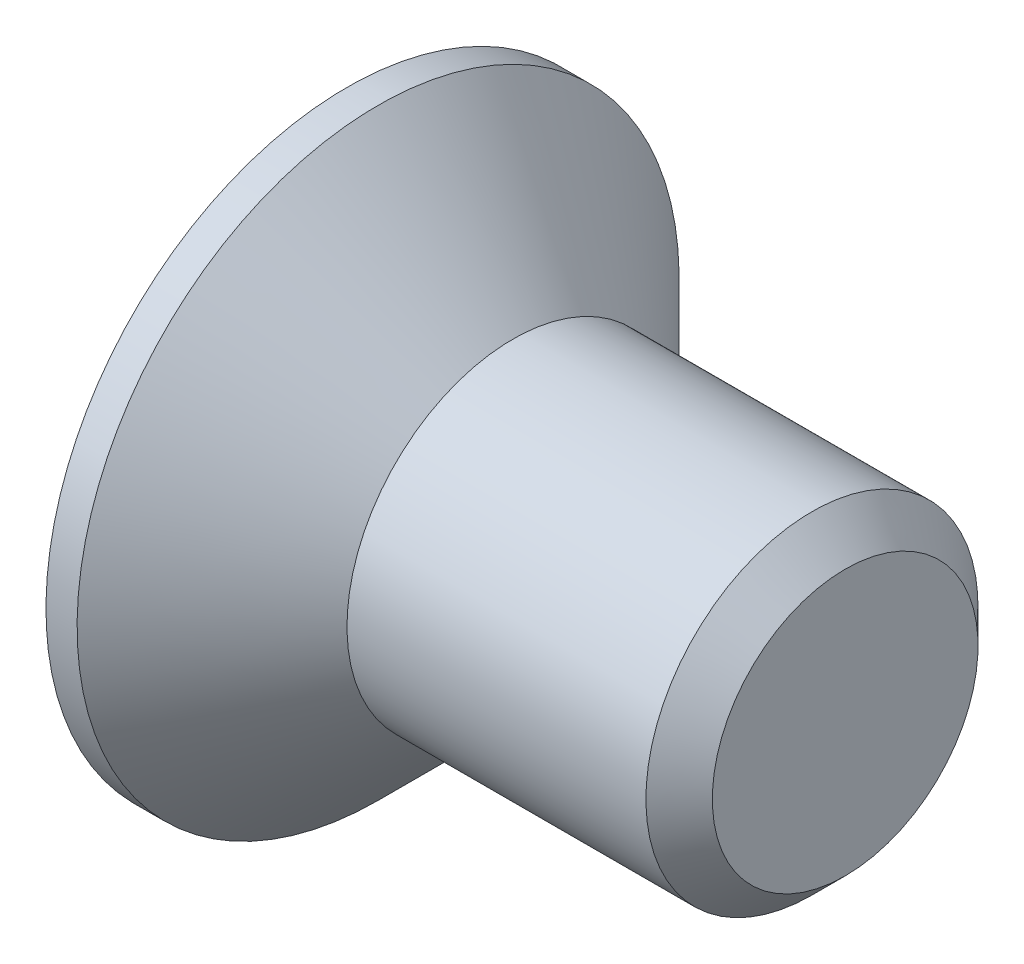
ISO-10303-21;
HEADER;
FILE_DESCRIPTION(('STEP AP214'),'2;1');
FILE_NAME('part.step','',(''),(''),'','','');
FILE_SCHEMA(('AUTOMOTIVE_DESIGN { 1 0 10303 214 1 1 1 1 }'));
ENDSEC;
DATA;
#1=APPLICATION_CONTEXT('core data for automotive mechanical design processes');
#2=APPLICATION_PROTOCOL_DEFINITION('international standard','automotive_design',2000,#1);
#3=PRODUCT_CONTEXT('',#1,'mechanical');
#4=PRODUCT('Part','Part','',(#3));
#5=PRODUCT_RELATED_PRODUCT_CATEGORY('part','',(#4));
#6=PRODUCT_DEFINITION_FORMATION('','',#4);
#7=PRODUCT_DEFINITION_CONTEXT('part definition',#1,'design');
#8=PRODUCT_DEFINITION('design','',#6,#7);
#9=PRODUCT_DEFINITION_SHAPE('','',#8);
#10=(LENGTH_UNIT() NAMED_UNIT(*) SI_UNIT(.MILLI.,.METRE.));
#11=(NAMED_UNIT(*) PLANE_ANGLE_UNIT() SI_UNIT($,.RADIAN.));
#12=(NAMED_UNIT(*) SI_UNIT($,.STERADIAN.) SOLID_ANGLE_UNIT());
#13=UNCERTAINTY_MEASURE_WITH_UNIT(LENGTH_MEASURE(1.E-05),#10,'distance_accuracy_value','');
#14=(GEOMETRIC_REPRESENTATION_CONTEXT(3) GLOBAL_UNCERTAINTY_ASSIGNED_CONTEXT((#13)) GLOBAL_UNIT_ASSIGNED_CONTEXT((#10,
#11,#12)) REPRESENTATION_CONTEXT('',''));
#15=CARTESIAN_POINT('',(0.,0.,0.));
#16=DIRECTION('',(0.,0.,1.));
#17=DIRECTION('',(1.,0.,0.));
#18=AXIS2_PLACEMENT_3D('',#15,#16,#17);
#19=CARTESIAN_POINT('',(0.,0.,0.));
#20=DIRECTION('',(-1.,0.,0.));
#21=DIRECTION('',(0.,-1.,0.));
#22=AXIS2_PLACEMENT_3D('',#19,#20,#21);
#23=CONICAL_SURFACE('',#22,4.,0.78539816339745);
#24=CARTESIAN_POINT('',(-3.24999999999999,0.,0.));
#25=DIRECTION('',(-1.,0.,0.));
#26=DIRECTION('',(0.,-1.,0.));
#27=AXIS2_PLACEMENT_3D('',#24,#25,#26);
#28=CIRCLE('',#27,7.25);
#29=CARTESIAN_POINT('',(-3.24999999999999,-7.25,0.));
#30=VERTEX_POINT('',#29);
#31=EDGE_CURVE('E189',#30,#30,#28,.T.);
#32=ORIENTED_EDGE('',*,*,#31,.F.);
#33=EDGE_LOOP('',(#32));
#34=FACE_BOUND('',#33,.T.);
#35=CARTESIAN_POINT('',(0.,0.,0.));
#36=DIRECTION('',(-1.,0.,0.));
#37=DIRECTION('',(0.,-1.,0.));
#38=AXIS2_PLACEMENT_3D('',#35,#36,#37);
#39=CIRCLE('',#38,4.);
#40=CARTESIAN_POINT('',(0.,-4.,0.));
#41=VERTEX_POINT('',#40);
#42=EDGE_CURVE('E212',#41,#41,#39,.T.);
#43=ORIENTED_EDGE('',*,*,#42,.T.);
#44=EDGE_LOOP('',(#43));
#45=FACE_BOUND('',#44,.T.);
#46=ADVANCED_FACE('F33',(#34,#45),#23,.T.);
#47=CARTESIAN_POINT('',(-4.,0.,0.));
#48=DIRECTION('',(-1.,0.,0.));
#49=DIRECTION('',(0.,-1.,0.));
#50=AXIS2_PLACEMENT_3D('',#47,#48,#49);
#51=CYLINDRICAL_SURFACE('',#50,4.);
#52=CARTESIAN_POINT('',(7.2,0.,0.));
#53=DIRECTION('',(-1.,0.,0.));
#54=DIRECTION('',(0.,-1.,0.));
#55=AXIS2_PLACEMENT_3D('',#52,#53,#54);
#56=CIRCLE('',#55,4.);
#57=CARTESIAN_POINT('',(7.2,-4.,0.));
#58=VERTEX_POINT('',#57);
#59=EDGE_CURVE('E41',#58,#58,#56,.T.);
#60=ORIENTED_EDGE('',*,*,#59,.T.);
#61=EDGE_LOOP('',(#60));
#62=FACE_BOUND('',#61,.T.);
#63=ORIENTED_EDGE('',*,*,#42,.F.);
#64=EDGE_LOOP('',(#63));
#65=FACE_BOUND('',#64,.T.);
#66=ADVANCED_FACE('F217',(#62,#65),#51,.T.);
#67=CARTESIAN_POINT('',(8.,0.,0.));
#68=DIRECTION('',(-1.,0.,0.));
#69=DIRECTION('',(0.,-1.,0.));
#70=AXIS2_PLACEMENT_3D('',#67,#68,#69);
#71=PLANE('',#70);
#72=CARTESIAN_POINT('',(8.,0.,0.));
#73=DIRECTION('',(-1.,0.,0.));
#74=DIRECTION('',(0.,-1.,0.));
#75=AXIS2_PLACEMENT_3D('',#72,#73,#74);
#76=CIRCLE('',#75,3.2);
#77=CARTESIAN_POINT('',(8.,-3.2,0.));
#78=VERTEX_POINT('',#77);
#79=EDGE_CURVE('E11',#78,#78,#76,.F.);
#80=ORIENTED_EDGE('',*,*,#79,.T.);
#81=EDGE_LOOP('',(#80));
#82=FACE_BOUND('',#81,.T.);
#83=ADVANCED_FACE('F239',(#82),#71,.F.);
#84=CARTESIAN_POINT('',(-4.,7.25,0.));
#85=DIRECTION('',(1.,0.,0.));
#86=DIRECTION('',(0.,1.,0.));
#87=AXIS2_PLACEMENT_3D('',#84,#85,#86);
#88=PLANE('',#87);
#89=DIRECTION('',(0.,0.,-1.));
#90=VECTOR('',#89,1.);
#91=CARTESIAN_POINT('',(-4.,1.09,-4.35));
#92=LINE('',#91,#90);
#93=CARTESIAN_POINT('',(-4.,1.09,-1.09));
#94=VERTEX_POINT('',#93);
#95=CARTESIAN_POINT('',(-4.,1.09,-4.35));
#96=VERTEX_POINT('',#95);
#97=EDGE_CURVE('E158',#94,#96,#92,.T.);
#98=ORIENTED_EDGE('',*,*,#97,.F.);
#99=DIRECTION('',(0.,-1.,0.));
#100=VECTOR('',#99,1.);
#101=CARTESIAN_POINT('',(-4.,1.09,-1.09));
#102=LINE('',#101,#100);
#103=CARTESIAN_POINT('',(-4.,4.35,-1.09));
#104=VERTEX_POINT('',#103);
#105=EDGE_CURVE('E48',#104,#94,#102,.T.);
#106=ORIENTED_EDGE('',*,*,#105,.F.);
#107=DIRECTION('',(0.,0.,-1.));
#108=VECTOR('',#107,1.);
#109=CARTESIAN_POINT('',(-4.,4.35,-1.09));
#110=LINE('',#109,#108);
#111=CARTESIAN_POINT('',(-4.,4.35,1.09));
#112=VERTEX_POINT('',#111);
#113=EDGE_CURVE('E185',#112,#104,#110,.T.);
#114=ORIENTED_EDGE('',*,*,#113,.F.);
#115=DIRECTION('',(0.,1.,0.));
#116=VECTOR('',#115,1.);
#117=CARTESIAN_POINT('',(-4.,4.35,1.09));
#118=LINE('',#117,#116);
#119=CARTESIAN_POINT('',(-4.,1.09,1.09));
#120=VERTEX_POINT('',#119);
#121=EDGE_CURVE('E183',#120,#112,#118,.T.);
#122=ORIENTED_EDGE('',*,*,#121,.F.);
#123=DIRECTION('',(0.,0.,-1.));
#124=VECTOR('',#123,1.);
#125=CARTESIAN_POINT('',(-4.,1.09,1.09));
#126=LINE('',#125,#124);
#127=CARTESIAN_POINT('',(-4.,1.09,4.35));
#128=VERTEX_POINT('',#127);
#129=EDGE_CURVE('E132',#128,#120,#126,.T.);
#130=ORIENTED_EDGE('',*,*,#129,.F.);
#131=DIRECTION('',(0.,1.,0.));
#132=VECTOR('',#131,1.);
#133=CARTESIAN_POINT('',(-4.,1.09,4.35));
#134=LINE('',#133,#132);
#135=CARTESIAN_POINT('',(-4.,-1.09,4.35));
#136=VERTEX_POINT('',#135);
#137=EDGE_CURVE('E179',#136,#128,#134,.T.);
#138=ORIENTED_EDGE('',*,*,#137,.F.);
#139=DIRECTION('',(0.,0.,1.));
#140=VECTOR('',#139,1.);
#141=CARTESIAN_POINT('',(-4.,-1.09,4.35));
#142=LINE('',#141,#140);
#143=CARTESIAN_POINT('',(-4.,-1.09,1.09));
#144=VERTEX_POINT('',#143);
#145=EDGE_CURVE('E176',#144,#136,#142,.T.);
#146=ORIENTED_EDGE('',*,*,#145,.F.);
#147=DIRECTION('',(0.,1.,0.));
#148=VECTOR('',#147,1.);
#149=CARTESIAN_POINT('',(-4.,-1.09,1.09));
#150=LINE('',#149,#148);
#151=CARTESIAN_POINT('',(-4.,-4.35,1.09));
#152=VERTEX_POINT('',#151);
#153=EDGE_CURVE('E173',#152,#144,#150,.T.);
#154=ORIENTED_EDGE('',*,*,#153,.F.);
#155=DIRECTION('',(0.,0.,1.));
#156=VECTOR('',#155,1.);
#157=CARTESIAN_POINT('',(-4.,-4.35,1.09));
#158=LINE('',#157,#156);
#159=CARTESIAN_POINT('',(-4.,-4.35,-1.09));
#160=VERTEX_POINT('',#159);
#161=EDGE_CURVE('E170',#160,#152,#158,.T.);
#162=ORIENTED_EDGE('',*,*,#161,.F.);
#163=DIRECTION('',(0.,-1.,0.));
#164=VECTOR('',#163,1.);
#165=CARTESIAN_POINT('',(-4.,-4.35,-1.09));
#166=LINE('',#165,#164);
#167=CARTESIAN_POINT('',(-4.,-1.09,-1.09));
#168=VERTEX_POINT('',#167);
#169=EDGE_CURVE('E167',#168,#160,#166,.T.);
#170=ORIENTED_EDGE('',*,*,#169,.F.);
#171=DIRECTION('',(0.,0.,1.));
#172=VECTOR('',#171,1.);
#173=CARTESIAN_POINT('',(-4.,-1.09,-1.09));
#174=LINE('',#173,#172);
#175=CARTESIAN_POINT('',(-4.,-1.09,-4.35));
#176=VERTEX_POINT('',#175);
#177=EDGE_CURVE('E164',#176,#168,#174,.T.);
#178=ORIENTED_EDGE('',*,*,#177,.F.);
#179=DIRECTION('',(0.,-1.,0.));
#180=VECTOR('',#179,1.);
#181=CARTESIAN_POINT('',(-4.,-1.09,-4.35));
#182=LINE('',#181,#180);
#183=EDGE_CURVE('E161',#96,#176,#182,.T.);
#184=ORIENTED_EDGE('',*,*,#183,.F.);
#185=EDGE_LOOP('',(#98,#106,#114,#122,#130,#138,#146,#154,#162,#170,#178,#184));
#186=FACE_BOUND('',#185,.T.);
#187=CARTESIAN_POINT('',(-4.,0.,0.));
#188=DIRECTION('',(-1.,0.,0.));
#189=DIRECTION('',(0.,-1.,0.));
#190=AXIS2_PLACEMENT_3D('',#187,#188,#189);
#191=CIRCLE('',#190,7.25);
#192=CARTESIAN_POINT('',(-4.,-7.25,0.));
#193=VERTEX_POINT('',#192);
#194=EDGE_CURVE('E209',#193,#193,#191,.T.);
#195=ORIENTED_EDGE('',*,*,#194,.T.);
#196=EDGE_LOOP('',(#195));
#197=FACE_BOUND('',#196,.T.);
#198=ADVANCED_FACE('F230',(#186,#197),#88,.F.);
#199=CARTESIAN_POINT('',(-4.,0.,0.));
#200=DIRECTION('',(-1.,0.,0.));
#201=DIRECTION('',(0.,-1.,0.));
#202=AXIS2_PLACEMENT_3D('',#199,#200,#201);
#203=CYLINDRICAL_SURFACE('',#202,7.25);
#204=ORIENTED_EDGE('',*,*,#194,.F.);
#205=EDGE_LOOP('',(#204));
#206=FACE_BOUND('',#205,.T.);
#207=ORIENTED_EDGE('',*,*,#31,.T.);
#208=EDGE_LOOP('',(#207));
#209=FACE_BOUND('',#208,.T.);
#210=ADVANCED_FACE('F222',(#206,#209),#203,.T.);
#211=CARTESIAN_POINT('',(7.2,0.,0.));
#212=DIRECTION('',(-1.,0.,0.));
#213=DIRECTION('',(0.,-1.,0.));
#214=AXIS2_PLACEMENT_3D('',#211,#212,#213);
#215=CONICAL_SURFACE('',#214,4.,0.785398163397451);
#216=ORIENTED_EDGE('',*,*,#79,.F.);
#217=EDGE_LOOP('',(#216));
#218=FACE_BOUND('',#217,.T.);
#219=ORIENTED_EDGE('',*,*,#59,.F.);
#220=EDGE_LOOP('',(#219));
#221=FACE_BOUND('',#220,.T.);
#222=ADVANCED_FACE('F35',(#218,#221),#215,.T.);
#223=CARTESIAN_POINT('',(-0.55,1.09,-1.09));
#224=DIRECTION('',(0.,0.,-1.));
#225=DIRECTION('',(-1.,0.,0.));
#226=AXIS2_PLACEMENT_3D('',#223,#224,#225);
#227=PLANE('',#226);
#228=ORIENTED_EDGE('',*,*,#105,.T.);
#229=DIRECTION('',(-1.,0.,0.));
#230=VECTOR('',#229,1.);
#231=CARTESIAN_POINT('',(-0.55,1.09,-1.09));
#232=LINE('',#231,#230);
#233=CARTESIAN_POINT('',(-0.55,1.09,-1.09));
#234=VERTEX_POINT('',#233);
#235=EDGE_CURVE('E96',#234,#94,#232,.T.);
#236=ORIENTED_EDGE('',*,*,#235,.F.);
#237=DIRECTION('',(0.,-1.,0.));
#238=VECTOR('',#237,1.);
#239=CARTESIAN_POINT('',(-0.55,1.09,-1.09));
#240=LINE('',#239,#238);
#241=CARTESIAN_POINT('',(-0.55,4.35,-1.09));
#242=VERTEX_POINT('',#241);
#243=EDGE_CURVE('E187',#242,#234,#240,.T.);
#244=ORIENTED_EDGE('',*,*,#243,.F.);
#245=DIRECTION('',(-1.,0.,0.));
#246=VECTOR('',#245,1.);
#247=CARTESIAN_POINT('',(-0.55,4.35,-1.09));
#248=LINE('',#247,#246);
#249=EDGE_CURVE('E56',#242,#104,#248,.T.);
#250=ORIENTED_EDGE('',*,*,#249,.T.);
#251=EDGE_LOOP('',(#228,#236,#244,#250));
#252=FACE_BOUND('',#251,.T.);
#253=ADVANCED_FACE('F221',(#252),#227,.F.);
#254=CARTESIAN_POINT('',(-0.55,4.35,-1.09));
#255=DIRECTION('',(0.,1.,0.));
#256=DIRECTION('',(-1.,0.,0.));
#257=AXIS2_PLACEMENT_3D('',#254,#255,#256);
#258=PLANE('',#257);
#259=ORIENTED_EDGE('',*,*,#113,.T.);
#260=ORIENTED_EDGE('',*,*,#249,.F.);
#261=DIRECTION('',(0.,0.,-1.));
#262=VECTOR('',#261,1.);
#263=CARTESIAN_POINT('',(-0.55,4.35,-1.09));
#264=LINE('',#263,#262);
#265=CARTESIAN_POINT('',(-0.55,4.35,1.09));
#266=VERTEX_POINT('',#265);
#267=EDGE_CURVE('E144',#266,#242,#264,.T.);
#268=ORIENTED_EDGE('',*,*,#267,.F.);
#269=DIRECTION('',(-1.,0.,0.));
#270=VECTOR('',#269,1.);
#271=CARTESIAN_POINT('',(-0.55,4.35,1.09));
#272=LINE('',#271,#270);
#273=EDGE_CURVE('E136',#266,#112,#272,.T.);
#274=ORIENTED_EDGE('',*,*,#273,.T.);
#275=EDGE_LOOP('',(#259,#260,#268,#274));
#276=FACE_BOUND('',#275,.T.);
#277=ADVANCED_FACE('F228',(#276),#258,.F.);
#278=CARTESIAN_POINT('',(-0.55,4.35,1.09));
#279=DIRECTION('',(0.,0.,1.));
#280=DIRECTION('',(1.,0.,0.));
#281=AXIS2_PLACEMENT_3D('',#278,#279,#280);
#282=PLANE('',#281);
#283=ORIENTED_EDGE('',*,*,#121,.T.);
#284=ORIENTED_EDGE('',*,*,#273,.F.);
#285=DIRECTION('',(0.,1.,0.));
#286=VECTOR('',#285,1.);
#287=CARTESIAN_POINT('',(-0.55,4.35,1.09));
#288=LINE('',#287,#286);
#289=CARTESIAN_POINT('',(-0.55,1.09,1.09));
#290=VERTEX_POINT('',#289);
#291=EDGE_CURVE('E140',#290,#266,#288,.T.);
#292=ORIENTED_EDGE('',*,*,#291,.F.);
#293=DIRECTION('',(-1.,0.,0.));
#294=VECTOR('',#293,1.);
#295=CARTESIAN_POINT('',(-0.55,1.09,1.09));
#296=LINE('',#295,#294);
#297=EDGE_CURVE('E125',#290,#120,#296,.T.);
#298=ORIENTED_EDGE('',*,*,#297,.T.);
#299=EDGE_LOOP('',(#283,#284,#292,#298));
#300=FACE_BOUND('',#299,.T.);
#301=ADVANCED_FACE('F141',(#300),#282,.F.);
#302=CARTESIAN_POINT('',(-0.55,1.09,1.09));
#303=DIRECTION('',(0.,1.,0.));
#304=DIRECTION('',(-1.,0.,0.));
#305=AXIS2_PLACEMENT_3D('',#302,#303,#304);
#306=PLANE('',#305);
#307=ORIENTED_EDGE('',*,*,#129,.T.);
#308=ORIENTED_EDGE('',*,*,#297,.F.);
#309=DIRECTION('',(0.,0.,-1.));
#310=VECTOR('',#309,1.);
#311=CARTESIAN_POINT('',(-0.55,1.09,1.09));
#312=LINE('',#311,#310);
#313=CARTESIAN_POINT('',(-0.55,1.09,4.35));
#314=VERTEX_POINT('',#313);
#315=EDGE_CURVE('E129',#314,#290,#312,.T.);
#316=ORIENTED_EDGE('',*,*,#315,.F.);
#317=DIRECTION('',(-1.,0.,0.));
#318=VECTOR('',#317,1.);
#319=CARTESIAN_POINT('',(-0.55,1.09,4.35));
#320=LINE('',#319,#318);
#321=EDGE_CURVE('E137',#314,#128,#320,.T.);
#322=ORIENTED_EDGE('',*,*,#321,.T.);
#323=EDGE_LOOP('',(#307,#308,#316,#322));
#324=FACE_BOUND('',#323,.T.);
#325=ADVANCED_FACE('F127',(#324),#306,.F.);
#326=CARTESIAN_POINT('',(-0.55,1.09,4.35));
#327=DIRECTION('',(0.,0.,1.));
#328=DIRECTION('',(1.,0.,0.));
#329=AXIS2_PLACEMENT_3D('',#326,#327,#328);
#330=PLANE('',#329);
#331=ORIENTED_EDGE('',*,*,#137,.T.);
#332=ORIENTED_EDGE('',*,*,#321,.F.);
#333=DIRECTION('',(0.,1.,0.));
#334=VECTOR('',#333,1.);
#335=CARTESIAN_POINT('',(-0.55,1.09,4.35));
#336=LINE('',#335,#334);
#337=CARTESIAN_POINT('',(-0.55,-1.09,4.35));
#338=VERTEX_POINT('',#337);
#339=EDGE_CURVE('E150',#338,#314,#336,.T.);
#340=ORIENTED_EDGE('',*,*,#339,.F.);
#341=DIRECTION('',(-1.,0.,0.));
#342=VECTOR('',#341,1.);
#343=CARTESIAN_POINT('',(-0.55,-1.09,4.35));
#344=LINE('',#343,#342);
#345=EDGE_CURVE('E192',#338,#136,#344,.T.);
#346=ORIENTED_EDGE('',*,*,#345,.T.);
#347=EDGE_LOOP('',(#331,#332,#340,#346));
#348=FACE_BOUND('',#347,.T.);
#349=ADVANCED_FACE('F277',(#348),#330,.F.);
#350=CARTESIAN_POINT('',(-0.55,-1.09,4.35));
#351=DIRECTION('',(0.,-1.,0.));
#352=DIRECTION('',(1.,0.,0.));
#353=AXIS2_PLACEMENT_3D('',#350,#351,#352);
#354=PLANE('',#353);
#355=ORIENTED_EDGE('',*,*,#145,.T.);
#356=ORIENTED_EDGE('',*,*,#345,.F.);
#357=DIRECTION('',(0.,0.,1.));
#358=VECTOR('',#357,1.);
#359=CARTESIAN_POINT('',(-0.55,-1.09,4.35));
#360=LINE('',#359,#358);
#361=CARTESIAN_POINT('',(-0.55,-1.09,1.09));
#362=VERTEX_POINT('',#361);
#363=EDGE_CURVE('E152',#362,#338,#360,.T.);
#364=ORIENTED_EDGE('',*,*,#363,.F.);
#365=DIRECTION('',(-1.,0.,0.));
#366=VECTOR('',#365,1.);
#367=CARTESIAN_POINT('',(-0.55,-1.09,1.09));
#368=LINE('',#367,#366);
#369=EDGE_CURVE('E194',#362,#144,#368,.T.);
#370=ORIENTED_EDGE('',*,*,#369,.T.);
#371=EDGE_LOOP('',(#355,#356,#364,#370));
#372=FACE_BOUND('',#371,.T.);
#373=ADVANCED_FACE('F273',(#372),#354,.F.);
#374=CARTESIAN_POINT('',(-0.55,-1.09,1.09));
#375=DIRECTION('',(0.,0.,1.));
#376=DIRECTION('',(1.,0.,0.));
#377=AXIS2_PLACEMENT_3D('',#374,#375,#376);
#378=PLANE('',#377);
#379=ORIENTED_EDGE('',*,*,#153,.T.);
#380=ORIENTED_EDGE('',*,*,#369,.F.);
#381=DIRECTION('',(0.,1.,0.));
#382=VECTOR('',#381,1.);
#383=CARTESIAN_POINT('',(-0.55,-1.09,1.09));
#384=LINE('',#383,#382);
#385=CARTESIAN_POINT('',(-0.55,-4.35,1.09));
#386=VERTEX_POINT('',#385);
#387=EDGE_CURVE('E422',#386,#362,#384,.T.);
#388=ORIENTED_EDGE('',*,*,#387,.F.);
#389=DIRECTION('',(-1.,0.,0.));
#390=VECTOR('',#389,1.);
#391=CARTESIAN_POINT('',(-0.55,-4.35,1.09));
#392=LINE('',#391,#390);
#393=EDGE_CURVE('E196',#386,#152,#392,.T.);
#394=ORIENTED_EDGE('',*,*,#393,.T.);
#395=EDGE_LOOP('',(#379,#380,#388,#394));
#396=FACE_BOUND('',#395,.T.);
#397=ADVANCED_FACE('F269',(#396),#378,.F.);
#398=CARTESIAN_POINT('',(-0.55,-4.35,1.09));
#399=DIRECTION('',(0.,-1.,0.));
#400=DIRECTION('',(1.,0.,0.));
#401=AXIS2_PLACEMENT_3D('',#398,#399,#400);
#402=PLANE('',#401);
#403=ORIENTED_EDGE('',*,*,#161,.T.);
#404=ORIENTED_EDGE('',*,*,#393,.F.);
#405=DIRECTION('',(0.,0.,1.));
#406=VECTOR('',#405,1.);
#407=CARTESIAN_POINT('',(-0.55,-4.35,1.09));
#408=LINE('',#407,#406);
#409=CARTESIAN_POINT('',(-0.55,-4.35,-1.09));
#410=VERTEX_POINT('',#409);
#411=EDGE_CURVE('E419',#410,#386,#408,.T.);
#412=ORIENTED_EDGE('',*,*,#411,.F.);
#413=DIRECTION('',(-1.,0.,0.));
#414=VECTOR('',#413,1.);
#415=CARTESIAN_POINT('',(-0.55,-4.35,-1.09));
#416=LINE('',#415,#414);
#417=EDGE_CURVE('E198',#410,#160,#416,.T.);
#418=ORIENTED_EDGE('',*,*,#417,.T.);
#419=EDGE_LOOP('',(#403,#404,#412,#418));
#420=FACE_BOUND('',#419,.T.);
#421=ADVANCED_FACE('F265',(#420),#402,.F.);
#422=CARTESIAN_POINT('',(-0.55,-4.35,-1.09));
#423=DIRECTION('',(0.,0.,-1.));
#424=DIRECTION('',(-1.,0.,0.));
#425=AXIS2_PLACEMENT_3D('',#422,#423,#424);
#426=PLANE('',#425);
#427=ORIENTED_EDGE('',*,*,#169,.T.);
#428=ORIENTED_EDGE('',*,*,#417,.F.);
#429=DIRECTION('',(0.,-1.,0.));
#430=VECTOR('',#429,1.);
#431=CARTESIAN_POINT('',(-0.55,-4.35,-1.09));
#432=LINE('',#431,#430);
#433=CARTESIAN_POINT('',(-0.55,-1.09,-1.09));
#434=VERTEX_POINT('',#433);
#435=EDGE_CURVE('E416',#434,#410,#432,.T.);
#436=ORIENTED_EDGE('',*,*,#435,.F.);
#437=DIRECTION('',(-1.,0.,0.));
#438=VECTOR('',#437,1.);
#439=CARTESIAN_POINT('',(-0.55,-1.09,-1.09));
#440=LINE('',#439,#438);
#441=EDGE_CURVE('E200',#434,#168,#440,.T.);
#442=ORIENTED_EDGE('',*,*,#441,.T.);
#443=EDGE_LOOP('',(#427,#428,#436,#442));
#444=FACE_BOUND('',#443,.T.);
#445=ADVANCED_FACE('F261',(#444),#426,.F.);
#446=CARTESIAN_POINT('',(-0.55,-1.09,-1.09));
#447=DIRECTION('',(0.,-1.,0.));
#448=DIRECTION('',(1.,0.,0.));
#449=AXIS2_PLACEMENT_3D('',#446,#447,#448);
#450=PLANE('',#449);
#451=ORIENTED_EDGE('',*,*,#177,.T.);
#452=ORIENTED_EDGE('',*,*,#441,.F.);
#453=DIRECTION('',(0.,0.,1.));
#454=VECTOR('',#453,1.);
#455=CARTESIAN_POINT('',(-0.55,-1.09,-1.09));
#456=LINE('',#455,#454);
#457=CARTESIAN_POINT('',(-0.55,-1.09,-4.35));
#458=VERTEX_POINT('',#457);
#459=EDGE_CURVE('E413',#458,#434,#456,.T.);
#460=ORIENTED_EDGE('',*,*,#459,.F.);
#461=DIRECTION('',(-1.,0.,0.));
#462=VECTOR('',#461,1.);
#463=CARTESIAN_POINT('',(-0.55,-1.09,-4.35));
#464=LINE('',#463,#462);
#465=EDGE_CURVE('E202',#458,#176,#464,.T.);
#466=ORIENTED_EDGE('',*,*,#465,.T.);
#467=EDGE_LOOP('',(#451,#452,#460,#466));
#468=FACE_BOUND('',#467,.T.);
#469=ADVANCED_FACE('F257',(#468),#450,.F.);
#470=CARTESIAN_POINT('',(-0.55,-1.09,-4.35));
#471=DIRECTION('',(0.,0.,-1.));
#472=DIRECTION('',(-1.,0.,0.));
#473=AXIS2_PLACEMENT_3D('',#470,#471,#472);
#474=PLANE('',#473);
#475=ORIENTED_EDGE('',*,*,#183,.T.);
#476=ORIENTED_EDGE('',*,*,#465,.F.);
#477=DIRECTION('',(0.,-1.,0.));
#478=VECTOR('',#477,1.);
#479=CARTESIAN_POINT('',(-0.55,-1.09,-4.35));
#480=LINE('',#479,#478);
#481=CARTESIAN_POINT('',(-0.55,1.09,-4.35));
#482=VERTEX_POINT('',#481);
#483=EDGE_CURVE('E408',#482,#458,#480,.T.);
#484=ORIENTED_EDGE('',*,*,#483,.F.);
#485=DIRECTION('',(-1.,0.,0.));
#486=VECTOR('',#485,1.);
#487=CARTESIAN_POINT('',(-0.55,1.09,-4.35));
#488=LINE('',#487,#486);
#489=EDGE_CURVE('E204',#482,#96,#488,.T.);
#490=ORIENTED_EDGE('',*,*,#489,.T.);
#491=EDGE_LOOP('',(#475,#476,#484,#490));
#492=FACE_BOUND('',#491,.T.);
#493=ADVANCED_FACE('F253',(#492),#474,.F.);
#494=CARTESIAN_POINT('',(-0.55,1.09,-4.35));
#495=DIRECTION('',(0.,1.,0.));
#496=DIRECTION('',(-1.,0.,0.));
#497=AXIS2_PLACEMENT_3D('',#494,#495,#496);
#498=PLANE('',#497);
#499=ORIENTED_EDGE('',*,*,#97,.T.);
#500=ORIENTED_EDGE('',*,*,#489,.F.);
#501=DIRECTION('',(0.,0.,-1.));
#502=VECTOR('',#501,1.);
#503=CARTESIAN_POINT('',(-0.55,1.09,-4.35));
#504=LINE('',#503,#502);
#505=EDGE_CURVE('E406',#234,#482,#504,.T.);
#506=ORIENTED_EDGE('',*,*,#505,.F.);
#507=ORIENTED_EDGE('',*,*,#235,.T.);
#508=EDGE_LOOP('',(#499,#500,#506,#507));
#509=FACE_BOUND('',#508,.T.);
#510=ADVANCED_FACE('F250',(#509),#498,.F.);
#511=CARTESIAN_POINT('',(-0.55,0.,0.));
#512=DIRECTION('',(1.,0.,0.));
#513=DIRECTION('',(0.,0.,-1.));
#514=AXIS2_PLACEMENT_3D('',#511,#512,#513);
#515=PLANE('',#514);
#516=ORIENTED_EDGE('',*,*,#243,.T.);
#517=ORIENTED_EDGE('',*,*,#505,.T.);
#518=ORIENTED_EDGE('',*,*,#483,.T.);
#519=ORIENTED_EDGE('',*,*,#459,.T.);
#520=ORIENTED_EDGE('',*,*,#435,.T.);
#521=ORIENTED_EDGE('',*,*,#411,.T.);
#522=ORIENTED_EDGE('',*,*,#387,.T.);
#523=ORIENTED_EDGE('',*,*,#363,.T.);
#524=ORIENTED_EDGE('',*,*,#339,.T.);
#525=ORIENTED_EDGE('',*,*,#315,.T.);
#526=ORIENTED_EDGE('',*,*,#291,.T.);
#527=ORIENTED_EDGE('',*,*,#267,.T.);
#528=EDGE_LOOP('',(#516,#517,#518,#519,#520,#521,#522,#523,#524,#525,#526,#527));
#529=FACE_BOUND('',#528,.T.);
#530=ADVANCED_FACE('F147',(#529),#515,.F.);
#531=CLOSED_SHELL('',(#46,#66,#83,#198,#210,#222,#253,#277,#301,#325,#349,#373,#397,#421,#445,
#469,#493,#510,#530));
#532=MANIFOLD_SOLID_BREP('B2',#531);
#533=ADVANCED_BREP_SHAPE_REPRESENTATION('',(#18,#532),#14);
#534=SHAPE_DEFINITION_REPRESENTATION(#9,#533);
ENDSEC;
END-ISO-10303-21;
